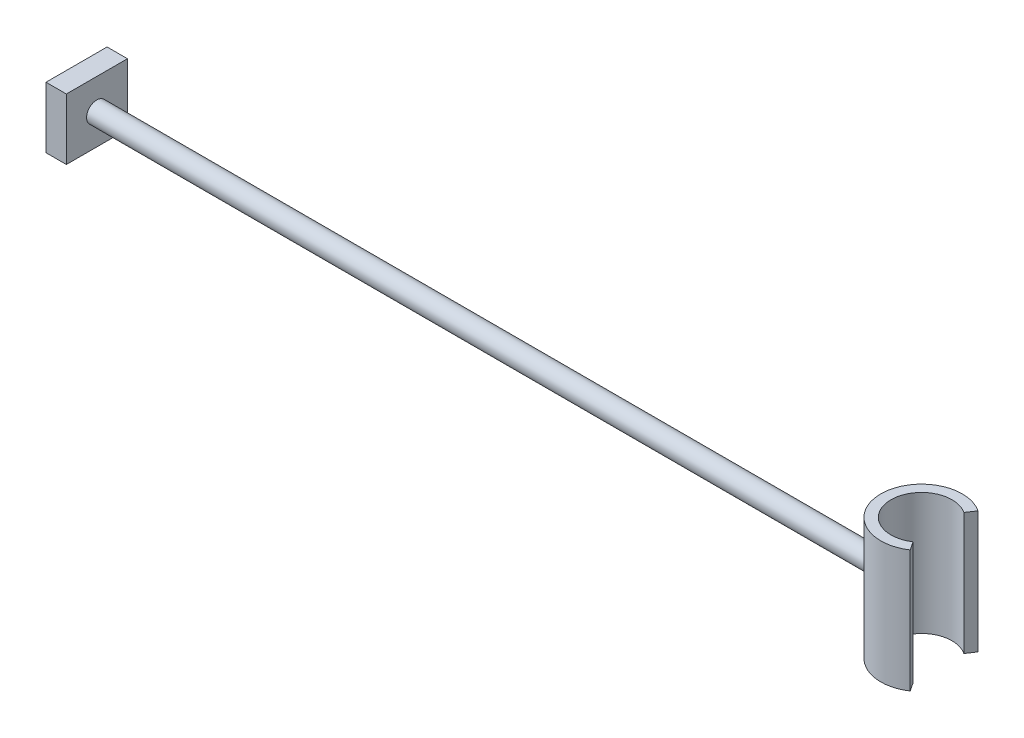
ISO-10303-21;
HEADER;
FILE_DESCRIPTION(('STEP AP214'),'2;1');
FILE_NAME('part.step','',(''),(''),'','','');
FILE_SCHEMA(('AUTOMOTIVE_DESIGN { 1 0 10303 214 1 1 1 1 }'));
ENDSEC;
DATA;
#1=APPLICATION_CONTEXT('core data for automotive mechanical design processes');
#2=APPLICATION_PROTOCOL_DEFINITION('international standard','automotive_design',2000,#1);
#3=PRODUCT_CONTEXT('',#1,'mechanical');
#4=PRODUCT('Part','Part','',(#3));
#5=PRODUCT_RELATED_PRODUCT_CATEGORY('part','',(#4));
#6=PRODUCT_DEFINITION_FORMATION('','',#4);
#7=PRODUCT_DEFINITION_CONTEXT('part definition',#1,'design');
#8=PRODUCT_DEFINITION('design','',#6,#7);
#9=PRODUCT_DEFINITION_SHAPE('','',#8);
#10=(LENGTH_UNIT() NAMED_UNIT(*) SI_UNIT(.MILLI.,.METRE.));
#11=(NAMED_UNIT(*) PLANE_ANGLE_UNIT() SI_UNIT($,.RADIAN.));
#12=(NAMED_UNIT(*) SI_UNIT($,.STERADIAN.) SOLID_ANGLE_UNIT());
#13=UNCERTAINTY_MEASURE_WITH_UNIT(LENGTH_MEASURE(1.E-05),#10,'distance_accuracy_value','');
#14=(GEOMETRIC_REPRESENTATION_CONTEXT(3) GLOBAL_UNCERTAINTY_ASSIGNED_CONTEXT((#13)) GLOBAL_UNIT_ASSIGNED_CONTEXT((#10,
#11,#12)) REPRESENTATION_CONTEXT('',''));
#15=CARTESIAN_POINT('',(0.,0.,0.));
#16=DIRECTION('',(0.,0.,1.));
#17=DIRECTION('',(1.,0.,0.));
#18=AXIS2_PLACEMENT_3D('',#15,#16,#17);
#19=CARTESIAN_POINT('',(-150.,0.,0.));
#20=DIRECTION('',(-1.,0.,0.));
#21=DIRECTION('',(0.,0.,1.));
#22=AXIS2_PLACEMENT_3D('',#19,#20,#21);
#23=CYLINDRICAL_SURFACE('',#22,2.5);
#24=CARTESIAN_POINT('',(197.817541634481,0.,2.5));
#25=CARTESIAN_POINT('',(197.817538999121,-0.138050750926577,2.49999607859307));
#26=CARTESIAN_POINT('',(197.814556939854,-0.276144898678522,2.48852624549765));
#27=CARTESIAN_POINT('',(197.802981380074,-0.54836757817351,2.44302312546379));
#28=CARTESIAN_POINT('',(197.794384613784,-0.682493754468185,2.40897670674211));
#29=CARTESIAN_POINT('',(197.772612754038,-0.942803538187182,2.31949119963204));
#30=CARTESIAN_POINT('',(197.759443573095,-1.06899715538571,2.26407972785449));
#31=CARTESIAN_POINT('',(197.730018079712,-1.31031085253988,2.13352114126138));
#32=CARTESIAN_POINT('',(197.713761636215,-1.42543046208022,2.05837318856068));
#33=CARTESIAN_POINT('',(197.679592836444,-1.64386164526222,1.88870842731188));
#34=CARTESIAN_POINT('',(197.66165402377,-1.74689360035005,1.79383688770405));
#35=CARTESIAN_POINT('',(197.626371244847,-1.93576139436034,1.58818206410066));
#36=CARTESIAN_POINT('',(197.609027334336,-2.02159562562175,1.47739729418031));
#37=CARTESIAN_POINT('',(197.576595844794,-2.17477546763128,1.24114520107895));
#38=CARTESIAN_POINT('',(197.561543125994,-2.24184638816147,1.11549457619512));
#39=CARTESIAN_POINT('',(197.53569188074,-2.35380964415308,0.854263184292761));
#40=CARTESIAN_POINT('',(197.524892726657,-2.39870525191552,0.718683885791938));
#41=CARTESIAN_POINT('',(197.508952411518,-2.46414783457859,0.444358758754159));
#42=CARTESIAN_POINT('',(197.503701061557,-2.48516964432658,0.305732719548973));
#43=CARTESIAN_POINT('',(197.499064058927,-2.50375837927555,0.0268288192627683));
#44=CARTESIAN_POINT('',(197.499677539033,-2.5013287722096,-0.113448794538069));
#45=CARTESIAN_POINT('',(197.506619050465,-2.47342514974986,-0.388380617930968));
#46=CARTESIAN_POINT('',(197.512819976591,-2.44846367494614,-0.523090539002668));
#47=CARTESIAN_POINT('',(197.530091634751,-2.3770287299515,-0.786345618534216));
#48=CARTESIAN_POINT('',(197.541162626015,-2.33055411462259,-0.914890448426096));
#49=CARTESIAN_POINT('',(197.567124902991,-2.21699742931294,-1.16351675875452));
#50=CARTESIAN_POINT('',(197.58204980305,-2.14973295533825,-1.28351127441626));
#51=CARTESIAN_POINT('',(197.614100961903,-1.99664432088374,-1.51068905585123));
#52=CARTESIAN_POINT('',(197.631227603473,-1.91081693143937,-1.61787008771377));
#53=CARTESIAN_POINT('',(197.666362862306,-1.72029125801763,-1.81943508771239));
#54=CARTESIAN_POINT('',(197.684382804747,-1.61514510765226,-1.91339419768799));
#55=CARTESIAN_POINT('',(197.718849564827,-1.39040002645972,-2.08244093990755));
#56=CARTESIAN_POINT('',(197.735296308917,-1.27080042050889,-2.15752769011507));
#57=CARTESIAN_POINT('',(197.764795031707,-1.01970996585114,-2.28697032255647));
#58=CARTESIAN_POINT('',(197.77783016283,-0.888164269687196,-2.34122391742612));
#59=CARTESIAN_POINT('',(197.798813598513,-0.617414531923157,-2.42671405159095));
#60=CARTESIAN_POINT('',(197.806762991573,-0.478212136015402,-2.45795551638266));
#61=CARTESIAN_POINT('',(197.816446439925,-0.20004049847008,-2.49582963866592));
#62=CARTESIAN_POINT('',(197.818339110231,-0.0611622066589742,-2.50309047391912));
#63=CARTESIAN_POINT('',(197.816126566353,0.215821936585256,-2.49451699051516));
#64=CARTESIAN_POINT('',(197.812021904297,0.353927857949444,-2.4786847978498));
#65=CARTESIAN_POINT('',(197.79842918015,0.623114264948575,-2.42492546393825));
#66=CARTESIAN_POINT('',(197.789030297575,0.7542727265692,-2.3873640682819));
#67=CARTESIAN_POINT('',(197.765992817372,1.00843145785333,-2.29161808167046));
#68=CARTESIAN_POINT('',(197.752353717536,1.13143075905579,-2.2334310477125));
#69=CARTESIAN_POINT('',(197.722038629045,1.3684412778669,-2.0967706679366));
#70=CARTESIAN_POINT('',(197.705308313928,1.48222884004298,-2.01792175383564));
#71=CARTESIAN_POINT('',(197.670829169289,1.69518836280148,-1.84265073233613));
#72=CARTESIAN_POINT('',(197.653080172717,1.79435791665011,-1.74622573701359));
#73=CARTESIAN_POINT('',(197.618025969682,1.97781104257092,-1.53565680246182));
#74=CARTESIAN_POINT('',(197.600742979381,2.06166006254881,-1.42112988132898));
#75=CARTESIAN_POINT('',(197.569027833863,2.20893586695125,-1.17925670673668));
#76=CARTESIAN_POINT('',(197.55459552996,2.27236371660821,-1.05191112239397));
#77=CARTESIAN_POINT('',(197.530298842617,2.37644603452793,-0.788895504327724));
#78=CARTESIAN_POINT('',(197.520401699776,2.41726428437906,-0.653293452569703));
#79=CARTESIAN_POINT('',(197.506147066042,2.47546033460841,-0.376874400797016));
#80=CARTESIAN_POINT('',(197.501788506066,2.49284265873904,-0.236058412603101));
#81=CARTESIAN_POINT('',(197.49914576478,2.50341897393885,0.0427088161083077));
#82=CARTESIAN_POINT('',(197.500700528,2.49725427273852,0.180634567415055));
#83=CARTESIAN_POINT('',(197.509352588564,2.46238043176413,0.453418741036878));
#84=CARTESIAN_POINT('',(197.516449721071,2.43367196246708,0.588277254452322));
#85=CARTESIAN_POINT('',(197.535364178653,2.35486945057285,0.850427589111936));
#86=CARTESIAN_POINT('',(197.54715588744,2.30489136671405,0.977756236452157));
#87=CARTESIAN_POINT('',(197.574217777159,2.18507355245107,1.22229263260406));
#88=CARTESIAN_POINT('',(197.589488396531,2.11523131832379,1.33949910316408));
#89=CARTESIAN_POINT('',(197.622318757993,1.95571191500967,1.56350482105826));
#90=CARTESIAN_POINT('',(197.639924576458,1.86559964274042,1.66998747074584));
#91=CARTESIAN_POINT('',(197.67523377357,1.66894287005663,1.86653755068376));
#92=CARTESIAN_POINT('',(197.692937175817,1.56239420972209,1.95660081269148));
#93=CARTESIAN_POINT('',(197.726813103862,1.33349646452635,2.11940506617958));
#94=CARTESIAN_POINT('',(197.742950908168,1.21088969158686,2.19179154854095));
#95=CARTESIAN_POINT('',(197.771401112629,0.95486127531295,2.31481724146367));
#96=CARTESIAN_POINT('',(197.78371629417,0.821447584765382,2.36547227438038));
#97=CARTESIAN_POINT('',(197.801202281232,0.573557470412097,2.43605632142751));
#98=CARTESIAN_POINT('',(197.807283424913,0.460267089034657,2.4599829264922));
#99=CARTESIAN_POINT('',(197.815454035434,0.23132782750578,2.49195573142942));
#100=CARTESIAN_POINT('',(197.817543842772,0.115679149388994,2.50000328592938));
#101=CARTESIAN_POINT('',(197.817541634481,0.,2.5));
#102=B_SPLINE_CURVE_WITH_KNOTS('',3,(#24,#25,#26,#27,#28,#29,#30,#31,#32,#33,#34,#35,#36,#37,
#38,#39,#40,#41,#42,#43,#44,#45,#46,#47,#48,#49,#50,#51,#52,#53,#54,#55,#56,#57,#58,#59,#60,#61,
#62,#63,#64,#65,#66,#67,#68,#69,#70,#71,#72,#73,#74,#75,#76,#77,#78,#79,#80,#81,#82,#83,#84,#85,
#86,#87,#88,#89,#90,#91,#92,#93,#94,#95,#96,#97,#98,#99,#100,#101),.UNSPECIFIED.,.T.,.F.,(4,2,2,
2,2,2,2,2,2,2,2,2,2,2,2,2,2,2,2,2,2,2,2,2,2,2,2,2,2,2,2,2,2,2,2,2,2,2,4),(0.,0.413727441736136,
0.827695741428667,1.24113072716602,1.65458326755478,2.07623954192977,2.49793521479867,
2.9255149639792,3.35303159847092,3.77188750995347,4.1906814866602,4.60018262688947,
5.00970556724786,5.42292874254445,5.83622385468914,6.26070466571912,6.68520531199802,
7.11176432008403,7.53823200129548,7.95343574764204,8.36860127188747,8.77697405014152,
9.18539521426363,9.60182845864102,10.0183301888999,10.4452533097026,10.872154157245,
11.2959207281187,11.7196054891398,12.131834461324,12.5440511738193,12.9540487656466,
13.3640980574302,13.7839709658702,14.2039503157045,14.6317647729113,15.0592672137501,
15.4059782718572,15.7526597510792),.UNSPECIFIED.);
#103=CARTESIAN_POINT('',(197.817541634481,0.,2.5));
#104=VERTEX_POINT('',#103);
#105=EDGE_CURVE('E37',#104,#104,#102,.T.);
#106=ORIENTED_EDGE('',*,*,#105,.F.);
#107=EDGE_LOOP('',(#106));
#108=FACE_BOUND('',#107,.T.);
#109=CARTESIAN_POINT('',(5.,0.,0.));
#110=DIRECTION('',(-1.,0.,0.));
#111=DIRECTION('',(0.,0.,1.));
#112=AXIS2_PLACEMENT_3D('',#109,#110,#111);
#113=CIRCLE('',#112,2.5);
#114=CARTESIAN_POINT('',(5.,0.,2.5));
#115=VERTEX_POINT('',#114);
#116=EDGE_CURVE('E11',#115,#115,#113,.T.);
#117=ORIENTED_EDGE('',*,*,#116,.F.);
#118=EDGE_LOOP('',(#117));
#119=FACE_BOUND('',#118,.T.);
#120=ADVANCED_FACE('F29',(#108,#119),#23,.T.);
#121=CARTESIAN_POINT('',(207.5,15.,0.));
#122=DIRECTION('',(0.,-1.,0.));
#123=DIRECTION('',(0.,0.,-1.));
#124=AXIS2_PLACEMENT_3D('',#121,#122,#123);
#125=CYLINDRICAL_SURFACE('',#124,10.);
#126=DIRECTION('',(0.,-1.,0.));
#127=VECTOR('',#126,1.);
#128=CARTESIAN_POINT('',(213.047001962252,15.,-8.32050294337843));
#129=LINE('',#128,#127);
#130=CARTESIAN_POINT('',(213.047001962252,15.,-8.32050294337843));
#131=VERTEX_POINT('',#130);
#132=CARTESIAN_POINT('',(213.047001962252,-15.,-8.32050294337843));
#133=VERTEX_POINT('',#132);
#134=EDGE_CURVE('E157',#131,#133,#129,.T.);
#135=ORIENTED_EDGE('',*,*,#134,.T.);
#136=CARTESIAN_POINT('',(207.5,-15.,0.));
#137=DIRECTION('',(0.,1.,0.));
#138=DIRECTION('',(0.,0.,1.));
#139=AXIS2_PLACEMENT_3D('',#136,#137,#138);
#140=CIRCLE('',#139,10.);
#141=CARTESIAN_POINT('',(213.047001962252,-15.,8.32050294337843));
#142=VERTEX_POINT('',#141);
#143=EDGE_CURVE('E141',#133,#142,#140,.T.);
#144=ORIENTED_EDGE('',*,*,#143,.T.);
#145=DIRECTION('',(0.,-1.,0.));
#146=VECTOR('',#145,1.);
#147=CARTESIAN_POINT('',(213.047001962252,15.,8.32050294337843));
#148=LINE('',#147,#146);
#149=CARTESIAN_POINT('',(213.047001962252,15.,8.32050294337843));
#150=VERTEX_POINT('',#149);
#151=EDGE_CURVE('E155',#150,#142,#148,.T.);
#152=ORIENTED_EDGE('',*,*,#151,.F.);
#153=CARTESIAN_POINT('',(207.5,15.,0.));
#154=DIRECTION('',(0.,1.,0.));
#155=DIRECTION('',(0.,0.,1.));
#156=AXIS2_PLACEMENT_3D('',#153,#154,#155);
#157=CIRCLE('',#156,10.);
#158=EDGE_CURVE('E49',#131,#150,#157,.T.);
#159=ORIENTED_EDGE('',*,*,#158,.F.);
#160=EDGE_LOOP('',(#135,#144,#152,#159));
#161=FACE_BOUND('',#160,.T.);
#162=ORIENTED_EDGE('',*,*,#105,.T.);
#163=EDGE_LOOP('',(#162));
#164=FACE_BOUND('',#163,.T.);
#165=ADVANCED_FACE('F166',(#161,#164),#125,.T.);
#166=CARTESIAN_POINT('',(207.5,15.,0.));
#167=DIRECTION('',(0.,-1.,0.));
#168=DIRECTION('',(0.,0.,-1.));
#169=AXIS2_PLACEMENT_3D('',#166,#167,#168);
#170=CYLINDRICAL_SURFACE('',#169,7.5);
#171=DIRECTION('',(0.,-1.,0.));
#172=VECTOR('',#171,1.);
#173=CARTESIAN_POINT('',(211.660251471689,15.,6.24037720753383));
#174=LINE('',#173,#172);
#175=CARTESIAN_POINT('',(211.660251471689,15.,6.24037720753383));
#176=VERTEX_POINT('',#175);
#177=CARTESIAN_POINT('',(211.660251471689,-15.,6.24037720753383));
#178=VERTEX_POINT('',#177);
#179=EDGE_CURVE('E153',#176,#178,#174,.T.);
#180=ORIENTED_EDGE('',*,*,#179,.T.);
#181=CARTESIAN_POINT('',(207.5,-15.,0.));
#182=DIRECTION('',(0.,-1.,0.));
#183=DIRECTION('',(0.,0.,1.));
#184=AXIS2_PLACEMENT_3D('',#181,#182,#183);
#185=CIRCLE('',#184,7.5);
#186=CARTESIAN_POINT('',(211.660251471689,-15.,-6.24037720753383));
#187=VERTEX_POINT('',#186);
#188=EDGE_CURVE('E132',#178,#187,#185,.T.);
#189=ORIENTED_EDGE('',*,*,#188,.T.);
#190=DIRECTION('',(0.,-1.,0.));
#191=VECTOR('',#190,1.);
#192=CARTESIAN_POINT('',(211.660251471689,15.,-6.24037720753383));
#193=LINE('',#192,#191);
#194=CARTESIAN_POINT('',(211.660251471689,15.,-6.24037720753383));
#195=VERTEX_POINT('',#194);
#196=EDGE_CURVE('E159',#195,#187,#193,.T.);
#197=ORIENTED_EDGE('',*,*,#196,.F.);
#198=CARTESIAN_POINT('',(207.5,15.,0.));
#199=DIRECTION('',(0.,-1.,0.));
#200=DIRECTION('',(0.,0.,1.));
#201=AXIS2_PLACEMENT_3D('',#198,#199,#200);
#202=CIRCLE('',#201,7.5);
#203=EDGE_CURVE('E147',#176,#195,#202,.T.);
#204=ORIENTED_EDGE('',*,*,#203,.F.);
#205=EDGE_LOOP('',(#180,#189,#197,#204));
#206=FACE_BOUND('',#205,.T.);
#207=ADVANCED_FACE('F171',(#206),#170,.F.);
#208=CARTESIAN_POINT('',(211.660251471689,15.,-6.24037720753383));
#209=DIRECTION('',(-0.832050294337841,0.,-0.554700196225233));
#210=DIRECTION('',(-0.554700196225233,0.,0.832050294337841));
#211=AXIS2_PLACEMENT_3D('',#208,#209,#210);
#212=PLANE('',#211);
#213=ORIENTED_EDGE('',*,*,#196,.T.);
#214=DIRECTION('',(0.554700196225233,0.,-0.832050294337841));
#215=VECTOR('',#214,1.);
#216=CARTESIAN_POINT('',(211.660251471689,-15.,-6.24037720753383));
#217=LINE('',#216,#215);
#218=EDGE_CURVE('E138',#187,#133,#217,.T.);
#219=ORIENTED_EDGE('',*,*,#218,.T.);
#220=ORIENTED_EDGE('',*,*,#134,.F.);
#221=DIRECTION('',(0.554700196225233,0.,-0.832050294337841));
#222=VECTOR('',#221,1.);
#223=CARTESIAN_POINT('',(211.660251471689,15.,-6.24037720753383));
#224=LINE('',#223,#222);
#225=EDGE_CURVE('E149',#195,#131,#224,.T.);
#226=ORIENTED_EDGE('',*,*,#225,.F.);
#227=EDGE_LOOP('',(#213,#219,#220,#226));
#228=FACE_BOUND('',#227,.T.);
#229=ADVANCED_FACE('F175',(#228),#212,.F.);
#230=CARTESIAN_POINT('',(211.660251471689,15.,6.24037720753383));
#231=DIRECTION('',(-0.832050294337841,0.,0.554700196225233));
#232=DIRECTION('',(0.554700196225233,0.,0.832050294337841));
#233=AXIS2_PLACEMENT_3D('',#230,#231,#232);
#234=PLANE('',#233);
#235=ORIENTED_EDGE('',*,*,#151,.T.);
#236=DIRECTION('',(-0.554700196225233,0.,-0.832050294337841));
#237=VECTOR('',#236,1.);
#238=CARTESIAN_POINT('',(211.660251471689,-15.,6.24037720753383));
#239=LINE('',#238,#237);
#240=EDGE_CURVE('E144',#142,#178,#239,.T.);
#241=ORIENTED_EDGE('',*,*,#240,.T.);
#242=ORIENTED_EDGE('',*,*,#179,.F.);
#243=DIRECTION('',(-0.554700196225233,0.,-0.832050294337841));
#244=VECTOR('',#243,1.);
#245=CARTESIAN_POINT('',(211.660251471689,15.,6.24037720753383));
#246=LINE('',#245,#244);
#247=EDGE_CURVE('E44',#150,#176,#246,.T.);
#248=ORIENTED_EDGE('',*,*,#247,.F.);
#249=EDGE_LOOP('',(#235,#241,#242,#248));
#250=FACE_BOUND('',#249,.T.);
#251=ADVANCED_FACE('F173',(#250),#234,.F.);
#252=CARTESIAN_POINT('',(207.5,15.,0.));
#253=DIRECTION('',(0.,1.,0.));
#254=DIRECTION('',(0.,0.,1.));
#255=AXIS2_PLACEMENT_3D('',#252,#253,#254);
#256=PLANE('',#255);
#257=ORIENTED_EDGE('',*,*,#203,.T.);
#258=ORIENTED_EDGE('',*,*,#225,.T.);
#259=ORIENTED_EDGE('',*,*,#158,.T.);
#260=ORIENTED_EDGE('',*,*,#247,.T.);
#261=EDGE_LOOP('',(#257,#258,#259,#260));
#262=FACE_BOUND('',#261,.T.);
#263=ADVANCED_FACE('F201',(#262),#256,.T.);
#264=CARTESIAN_POINT('',(207.5,-15.,0.));
#265=DIRECTION('',(0.,1.,0.));
#266=DIRECTION('',(0.,0.,1.));
#267=AXIS2_PLACEMENT_3D('',#264,#265,#266);
#268=PLANE('',#267);
#269=ORIENTED_EDGE('',*,*,#188,.F.);
#270=ORIENTED_EDGE('',*,*,#240,.F.);
#271=ORIENTED_EDGE('',*,*,#143,.F.);
#272=ORIENTED_EDGE('',*,*,#218,.F.);
#273=EDGE_LOOP('',(#269,#270,#271,#272));
#274=FACE_BOUND('',#273,.T.);
#275=ADVANCED_FACE('F192',(#274),#268,.F.);
#276=CARTESIAN_POINT('',(5.,7.5,-7.54));
#277=DIRECTION('',(-1.,0.,0.));
#278=DIRECTION('',(0.,0.,1.));
#279=AXIS2_PLACEMENT_3D('',#276,#277,#278);
#280=PLANE('',#279);
#281=DIRECTION('',(0.,-1.,0.));
#282=VECTOR('',#281,1.);
#283=CARTESIAN_POINT('',(5.,7.5,-7.54));
#284=LINE('',#283,#282);
#285=CARTESIAN_POINT('',(5.,7.5,-7.54));
#286=VERTEX_POINT('',#285);
#287=CARTESIAN_POINT('',(5.,-7.5,-7.54));
#288=VERTEX_POINT('',#287);
#289=EDGE_CURVE('E101',#286,#288,#284,.T.);
#290=ORIENTED_EDGE('',*,*,#289,.F.);
#291=DIRECTION('',(0.,0.,-1.));
#292=VECTOR('',#291,1.);
#293=CARTESIAN_POINT('',(5.,7.5,-7.54));
#294=LINE('',#293,#292);
#295=CARTESIAN_POINT('',(5.,7.5,7.46));
#296=VERTEX_POINT('',#295);
#297=EDGE_CURVE('E106',#296,#286,#294,.T.);
#298=ORIENTED_EDGE('',*,*,#297,.F.);
#299=DIRECTION('',(0.,1.,0.));
#300=VECTOR('',#299,1.);
#301=CARTESIAN_POINT('',(5.,7.5,7.46));
#302=LINE('',#301,#300);
#303=CARTESIAN_POINT('',(5.,-7.5,7.46));
#304=VERTEX_POINT('',#303);
#305=EDGE_CURVE('E125',#304,#296,#302,.T.);
#306=ORIENTED_EDGE('',*,*,#305,.F.);
#307=DIRECTION('',(0.,0.,1.));
#308=VECTOR('',#307,1.);
#309=CARTESIAN_POINT('',(5.,-7.5,-7.54));
#310=LINE('',#309,#308);
#311=EDGE_CURVE('E123',#288,#304,#310,.T.);
#312=ORIENTED_EDGE('',*,*,#311,.F.);
#313=EDGE_LOOP('',(#290,#298,#306,#312));
#314=FACE_BOUND('',#313,.T.);
#315=ORIENTED_EDGE('',*,*,#116,.T.);
#316=EDGE_LOOP('',(#315));
#317=FACE_BOUND('',#316,.T.);
#318=ADVANCED_FACE('F190',(#314,#317),#280,.F.);
#319=CARTESIAN_POINT('',(5.,7.5,-7.54));
#320=DIRECTION('',(0.,0.,-1.));
#321=DIRECTION('',(0.,1.,0.));
#322=AXIS2_PLACEMENT_3D('',#319,#320,#321);
#323=PLANE('',#322);
#324=DIRECTION('',(0.,-1.,0.));
#325=VECTOR('',#324,1.);
#326=CARTESIAN_POINT('',(0.,7.5,-7.54));
#327=LINE('',#326,#325);
#328=CARTESIAN_POINT('',(0.,7.5,-7.54));
#329=VERTEX_POINT('',#328);
#330=CARTESIAN_POINT('',(0.,-7.5,-7.54));
#331=VERTEX_POINT('',#330);
#332=EDGE_CURVE('E98',#329,#331,#327,.T.);
#333=ORIENTED_EDGE('',*,*,#332,.F.);
#334=DIRECTION('',(-1.,0.,0.));
#335=VECTOR('',#334,1.);
#336=CARTESIAN_POINT('',(5.,7.5,-7.54));
#337=LINE('',#336,#335);
#338=EDGE_CURVE('E130',#286,#329,#337,.T.);
#339=ORIENTED_EDGE('',*,*,#338,.F.);
#340=ORIENTED_EDGE('',*,*,#289,.T.);
#341=DIRECTION('',(-1.,0.,0.));
#342=VECTOR('',#341,1.);
#343=CARTESIAN_POINT('',(5.,-7.5,-7.54));
#344=LINE('',#343,#342);
#345=EDGE_CURVE('E94',#288,#331,#344,.T.);
#346=ORIENTED_EDGE('',*,*,#345,.T.);
#347=EDGE_LOOP('',(#333,#339,#340,#346));
#348=FACE_BOUND('',#347,.T.);
#349=ADVANCED_FACE('F96',(#348),#323,.T.);
#350=CARTESIAN_POINT('',(5.,7.5,-7.54));
#351=DIRECTION('',(0.,1.,0.));
#352=DIRECTION('',(0.,0.,1.));
#353=AXIS2_PLACEMENT_3D('',#350,#351,#352);
#354=PLANE('',#353);
#355=DIRECTION('',(0.,0.,-1.));
#356=VECTOR('',#355,1.);
#357=CARTESIAN_POINT('',(0.,7.5,-7.54));
#358=LINE('',#357,#356);
#359=CARTESIAN_POINT('',(0.,7.5,7.46));
#360=VERTEX_POINT('',#359);
#361=EDGE_CURVE('E117',#360,#329,#358,.T.);
#362=ORIENTED_EDGE('',*,*,#361,.F.);
#363=DIRECTION('',(-1.,0.,0.));
#364=VECTOR('',#363,1.);
#365=CARTESIAN_POINT('',(5.,7.5,7.46));
#366=LINE('',#365,#364);
#367=EDGE_CURVE('E133',#296,#360,#366,.T.);
#368=ORIENTED_EDGE('',*,*,#367,.F.);
#369=ORIENTED_EDGE('',*,*,#297,.T.);
#370=ORIENTED_EDGE('',*,*,#338,.T.);
#371=EDGE_LOOP('',(#362,#368,#369,#370));
#372=FACE_BOUND('',#371,.T.);
#373=ADVANCED_FACE('F199',(#372),#354,.T.);
#374=CARTESIAN_POINT('',(5.,7.5,7.46));
#375=DIRECTION('',(0.,0.,1.));
#376=DIRECTION('',(0.,-1.,0.));
#377=AXIS2_PLACEMENT_3D('',#374,#375,#376);
#378=PLANE('',#377);
#379=DIRECTION('',(0.,1.,0.));
#380=VECTOR('',#379,1.);
#381=CARTESIAN_POINT('',(0.,7.5,7.46));
#382=LINE('',#381,#380);
#383=CARTESIAN_POINT('',(0.,-7.5,7.46));
#384=VERTEX_POINT('',#383);
#385=EDGE_CURVE('E114',#384,#360,#382,.T.);
#386=ORIENTED_EDGE('',*,*,#385,.F.);
#387=DIRECTION('',(-1.,0.,0.));
#388=VECTOR('',#387,1.);
#389=CARTESIAN_POINT('',(5.,-7.5,7.46));
#390=LINE('',#389,#388);
#391=EDGE_CURVE('E105',#304,#384,#390,.T.);
#392=ORIENTED_EDGE('',*,*,#391,.F.);
#393=ORIENTED_EDGE('',*,*,#305,.T.);
#394=ORIENTED_EDGE('',*,*,#367,.T.);
#395=EDGE_LOOP('',(#386,#392,#393,#394));
#396=FACE_BOUND('',#395,.T.);
#397=ADVANCED_FACE('F207',(#396),#378,.T.);
#398=CARTESIAN_POINT('',(5.,-7.5,-7.54));
#399=DIRECTION('',(0.,-1.,0.));
#400=DIRECTION('',(0.,0.,-1.));
#401=AXIS2_PLACEMENT_3D('',#398,#399,#400);
#402=PLANE('',#401);
#403=DIRECTION('',(0.,0.,1.));
#404=VECTOR('',#403,1.);
#405=CARTESIAN_POINT('',(0.,-7.5,-7.54));
#406=LINE('',#405,#404);
#407=EDGE_CURVE('E109',#331,#384,#406,.T.);
#408=ORIENTED_EDGE('',*,*,#407,.F.);
#409=ORIENTED_EDGE('',*,*,#345,.F.);
#410=ORIENTED_EDGE('',*,*,#311,.T.);
#411=ORIENTED_EDGE('',*,*,#391,.T.);
#412=EDGE_LOOP('',(#408,#409,#410,#411));
#413=FACE_BOUND('',#412,.T.);
#414=ADVANCED_FACE('F110',(#413),#402,.T.);
#415=CARTESIAN_POINT('',(0.,0.,0.));
#416=DIRECTION('',(1.,0.,0.));
#417=DIRECTION('',(0.,0.,-1.));
#418=AXIS2_PLACEMENT_3D('',#415,#416,#417);
#419=PLANE('',#418);
#420=ORIENTED_EDGE('',*,*,#332,.T.);
#421=ORIENTED_EDGE('',*,*,#407,.T.);
#422=ORIENTED_EDGE('',*,*,#385,.T.);
#423=ORIENTED_EDGE('',*,*,#361,.T.);
#424=EDGE_LOOP('',(#420,#421,#422,#423));
#425=FACE_BOUND('',#424,.T.);
#426=ADVANCED_FACE('F31',(#425),#419,.F.);
#427=CLOSED_SHELL('',(#120,#165,#207,#229,#251,#263,#275,#318,#349,#373,#397,#414,#426));
#428=MANIFOLD_SOLID_BREP('B2',#427);
#429=ADVANCED_BREP_SHAPE_REPRESENTATION('',(#18,#428),#14);
#430=SHAPE_DEFINITION_REPRESENTATION(#9,#429);
ENDSEC;
END-ISO-10303-21;
